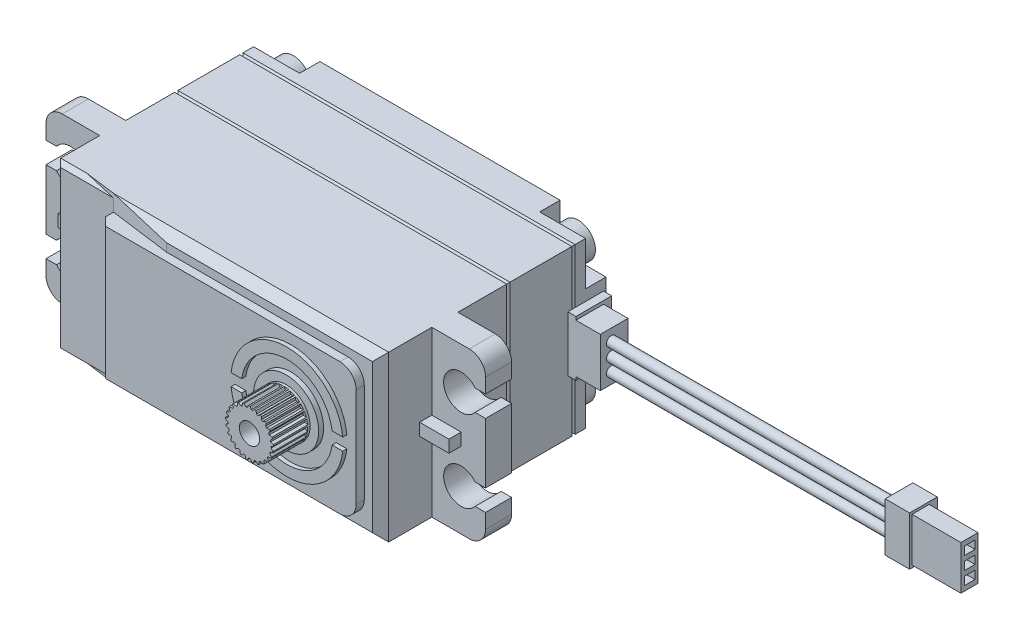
from build123d import *

# Parameters (mm, degrees)
SKETCH_1_W          = 40.8
SKETCH_1_H          = 20.2
EXTRUDE_1_DEPTH     = 4
CHAMFER_1_SIZE      = 0.2
SKETCH_2_W          = 40.8
SKETCH_2_H          = 20.2
EXTRUDE_2_DEPTH     = 8
CHAMFER_5_SIZE      = 0.2
SKETCH_3_W          = 40.8
SKETCH_3_H          = 20.2
EXTRUDE_3_DEPTH     = 15.7
CHAMFER_6_SIZE      = 0.2
CHAMFER_3_SIZE      = 1
CHAMFER_4_SIZE      = 0.2
SKETCH_4_R          = 6.9
EXTRUDE_4_DEPTH     = 1.5
SKETCH_5_R          = 4
EXTRUDE_5_DEPTH     = 0.1
SKETCH_6_R          = 2.95
EXTRUDE_6_DEPTH     = 4.5
SKETCH_7_R          = 1.25
CUT_EXTRUDE_1_DEPTH = 5
CUT_EXTRUDE_2_DEPTH = 4.2
EXTRUDE_7_DEPTH     = 3.2
FILLET_1_R          = 2
SKETCH_10_W         = 36.8
SKETCH_10_H         = 16.2
SKETCH_10_R         = 6.9
EXTRUDE_8_DEPTH     = 1
SKETCH_11_W         = 5
SKETCH_11_H         = 16.2
CUT_EXTRUDE_3_DEPTH = 1
FILLET_2_R          = 2
SKETCH_12_W         = 4.4
SKETCH_12_H         = 6.8
EXTRUDE_9_DEPTH     = 1
SKETCH_13_W         = 3.4
SKETCH_13_H         = 6
EXTRUDE_10_DEPTH    = 3
SKETCH_14_R         = 0.6
EXTRUDE_11_DEPTH    = 35
SKETCH_15_W         = 3.4
SKETCH_15_H         = 6
EXTRUDE_12_DEPTH    = 3
SKETCH_16_W         = 2.1
SKETCH_16_H         = 5.4
SKETCH_16_W_2       = 1.300246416
SKETCH_16_H_2       = 1
EXTRUDE_13_DEPTH    = 6
SKETCH_17_R         = 1
CUT_EXTRUDE_4_DEPTH = 2.5
SKETCH_18_R         = 1
CUT_EXTRUDE_5_DEPTH = 2.5
SKETCH_19_R         = 2.1
EXTRUDE_14_DEPTH    = 2
SKETCH_20_W         = 3.6
SKETCH_20_H         = 1.5
EXTRUDE_15_DEPTH    = 1.5
SKETCH_21_R         = 5.6
SKETCH_21_R_2       = 4
CUT_EXTRUDE_6_DEPTH = 0.5
CUT_EXTRUDE_7_DEPTH = 0.5
SKETCH_23_W         = 7
SKETCH_23_H         = 20.2
CUT_EXTRUDE_8_DEPTH = 1
CUT_EXTRUDE_9_DEPTH = 2
CHAMFER_7_SIZE      = 1
CHAMFER_9_SIZE      = 0.5


with BuildPart() as part:
    # Sketch 1 → Extrude 1 (new body)
    with BuildSketch(Plane.XY):
        Rectangle(SKETCH_1_W, SKETCH_1_H)
    extrude(amount=EXTRUDE_1_DEPTH)

    # Chamfer 1
    chamfer_1_edges = [part.edges().sort_by_distance(p)[0] for p in [
        (20.4, 0, 4),
        (0, 10.1, 4),
        (-20.4, 0, 4),
        (0, -10.1, 4),
    ]]
    chamfer(chamfer_1_edges, length=CHAMFER_1_SIZE)



with BuildPart() as body_2:
    # Sketch 2 → Extrude 2 (new body)
    with BuildSketch(Plane.XY.offset(4)):
        Rectangle(SKETCH_2_W, SKETCH_2_H)
    extrude(amount=EXTRUDE_2_DEPTH)

    # Chamfer 5
    chamfer_5_edges = [body_2.edges().sort_by_distance(p)[0] for p in [
        (0, -10.1, 12),
        (20.4, 0, 12),
        (0, 10.1, 12),
        (-20.4, 0, 12),
    ]]
    chamfer(chamfer_5_edges, length=CHAMFER_5_SIZE)

    # Chamfer 4
    chamfer_4_edges = [body_2.edges().sort_by_distance(p)[0] for p in [
        (20.4, 0, 4),
        (0, -10.1, 4),
        (-20.4, 0, 4),
        (0, 10.1, 4),
    ]]
    chamfer(chamfer_4_edges, length=CHAMFER_4_SIZE)


with BuildPart() as body_3:
    # Sketch 3 → Extrude 3 (new body)
    with BuildSketch(Plane.XY.offset(12)):
        Rectangle(SKETCH_3_W, SKETCH_3_H)
    extrude(amount=EXTRUDE_3_DEPTH)

    # Chamfer 6
    chamfer_6_edges = [body_3.edges().sort_by_distance(p)[0] for p in [
        (20.4, 0, 12),
        (0, -10.1, 12),
        (-20.4, 0, 12),
        (0, 10.1, 12),
    ]]
    chamfer(chamfer_6_edges, length=CHAMFER_6_SIZE)

    # Chamfer 3
    chamfer_3_edges = [body_3.edges().sort_by_distance(p)[0] for p in [
        (0, -10.1, 27.7),
        (20.4, 0, 27.7),
        (0, 10.1, 27.7),
        (-20.4, 0, 27.7),
    ]]
    chamfer(chamfer_3_edges, length=CHAMFER_3_SIZE)

    # Sketch 4 → Extrude 4 (add)
    with BuildSketch(Plane.XY.offset(27.7)):
        with Locations(Location((10.4, 0, 0), (0, 0, 180))):
            Circle(SKETCH_4_R)
    extrude(amount=EXTRUDE_4_DEPTH)

    # Sketch 5 → Extrude 5 (add)
    with BuildSketch(Plane.XY.offset(29.2)):
        with Locations((10.4, 0)):
            Circle(SKETCH_5_R)
    extrude(amount=EXTRUDE_5_DEPTH)

    # Sketch 6 → Extrude 6 (add)
    with BuildSketch(Plane.XY.offset(29.3)):
        with Locations((10.4, 0)):
            Circle(SKETCH_6_R)
    extrude(amount=EXTRUDE_6_DEPTH)

    # Sketch 7 → Cut-Extrude 1 (cut)
    with BuildSketch(Plane.XY.offset(33.8)):
        with Locations((10.4, 0)):
            Circle(SKETCH_7_R)
    extrude(amount=-CUT_EXTRUDE_1_DEPTH, mode=Mode.SUBTRACT)

    # Sketch 8 → Cut-Extrude 2 (cut)
    with BuildSketch(Plane.XY.offset(33.8)):
        with BuildLine():
            Line((11.036355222, 2.880547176), (10.812882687, 2.613339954))
            ThreePointArc((10.812882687, 2.613339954), (10.718629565, 2.62690868), (10.623963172, 2.637206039))
            Line((10.623963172, 2.637206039), (10.475180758, 2.949041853))
            ThreePointArc((10.475180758, 2.949041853), (10.757412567, 2.928268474), (11.036355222, 2.880547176))
        make_face()
        with BuildLine():
            Line((10.3, 2.948304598), (10.15, 2.633916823))
            ThreePointArc((10.15, 2.633916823), (10.055333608, 2.623619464), (9.961080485, 2.610050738))
            Line((9.961080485, 2.610050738), (9.739421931, 2.875088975))
            ThreePointArc((9.739421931, 2.875088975), (10.017953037, 2.925156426), (10.3, 2.948304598))
        make_face()
        with BuildLine():
            Line((11.732725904, 2.631794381), (11.449822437, 2.428557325))
            ThreePointArc((11.449822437, 2.428557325), (11.361904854, 2.465139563), (11.27277343, 2.498655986))
            Line((11.27277343, 2.498655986), (11.206215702, 2.837695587))
            ThreePointArc((11.206215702, 2.837695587), (11.47441455, 2.747386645), (11.732725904, 2.631794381))
        make_face()
        with BuildLine():
            Line((12.345356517, 2.217676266), (12.020797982, 2.091179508))
            ThreePointArc((12.020797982, 2.091179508), (11.944740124, 2.148476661), (11.866744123, 2.203106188))
            Line((11.866744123, 2.203106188), (11.886593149, 2.54804647))
            ThreePointArc((11.886593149, 2.54804647), (12.123907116, 2.393876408), (12.345356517, 2.217676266))
        make_face()
        with BuildLine():
            Line((12.835753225, 1.664213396), (12.489932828, 1.622405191))
            ThreePointArc((12.489932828, 1.622405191), (12.430513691, 1.696817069), (12.368553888, 1.769127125))
            Line((12.368553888, 1.769127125), (12.47356248, 2.098294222))
            ThreePointArc((12.47356248, 2.098294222), (12.665080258, 1.889950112), (12.835753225, 1.664213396))
        make_face()
        with BuildLine():
            Line((13.1731026, 1.006181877), (12.827749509, 1.051689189))
            ThreePointArc((12.827749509, 1.051689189), (12.788702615, 1.13854022), (12.746672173, 1.223987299))
            Line((12.746672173, 1.223987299), (12.930242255, 1.516698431))
            ThreePointArc((12.930242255, 1.516698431), (13.063930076, 1.2672713), (13.1731026, 1.006181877))
        make_face()
        with BuildLine():
            Line((13.33620774, 0.28492825), (13.01302176, 0.414891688))
            ThreePointArc((13.01302176, 0.414891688), (12.996800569, 0.508724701), (12.977340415, 0.601939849))
            Line((12.977340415, 0.601939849), (13.227937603, 0.8398029))
            ThreePointArc((13.227937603, 0.8398029), (13.295395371, 0.564965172), (13.33620774, 0.28492825))
        make_face()
        with BuildLine():
            Line((13.314820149, -0.454228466), (13.034108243, -0.247974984))
            ThreePointArc((13.034108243, -0.247974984), (13.041731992, -0.153055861), (13.04606488, -0.057929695))
            Line((13.04606488, -0.057929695), (13.347943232, 0.110139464))
            ThreePointArc((13.347943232, 0.110139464), (13.344932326, -0.172839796), (13.314820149, -0.454228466))
        make_face()
        with BuildLine():
            Line((13.110283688, -1.164844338), (12.889684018, -0.895260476))
            ThreePointArc((12.889684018, -0.895260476), (12.920673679, -0.805219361), (12.948527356, -0.714159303))
            Line((12.948527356, -0.714159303), (13.282718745, -0.626444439))
            ThreePointArc((13.282718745, -0.626444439), (13.209428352, -0.899784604), (13.110283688, -1.164844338))
        make_face()
        with BuildLine():
            Line((12.735450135, -1.802268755), (12.58882379, -1.486293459))
            ThreePointArc((12.58882379, -1.486293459), (12.641232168, -1.406787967), (12.690856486, -1.325515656))
            Line((12.690856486, -1.325515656), (13.036362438, -1.323666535))
            ThreePointArc((13.036362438, -1.323666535), (12.897397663, -1.570192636), (12.735450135, -1.802268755))
        make_face()
        with BuildLine():
            Line((12.213871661, -2.326449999), (12.150431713, -1.983937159))
            ThreePointArc((12.150431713, -1.983937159), (12.220965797, -1.919962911), (12.289242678, -1.853584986))
            Line((12.289242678, -1.853584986), (12.624353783, -1.937717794))
            ThreePointArc((12.624353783, -1.937717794), (12.428446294, -2.14193969), (12.213871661, -2.326449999))
        make_face()
        with BuildLine():
            Line((11.57832096, -2.704451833), (11.602053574, -2.35692279))
            ThreePointArc((11.602053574, -2.35692279), (11.686281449, -2.312499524), (11.768920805, -2.265186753))
            Line((11.768920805, -2.265186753), (12.072580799, -2.430015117))
            ThreePointArc((12.072580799, -2.430015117), (11.832040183, -2.579100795), (11.57832096, -2.704451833))
        make_face()
        with BuildLine():
            Line((10.868732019, -2.912523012), (10.978145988, -2.581814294))
            ThreePointArc((10.978145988, -2.581814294), (11.070775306, -2.559733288), (11.162584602, -2.534458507))
            Line((11.162584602, -2.534458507), (11.415713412, -2.769625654))
            ThreePointArc((11.415713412, -2.769625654), (11.145653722, -2.854207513), (10.868732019, -2.912523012))
        make_face()
        with BuildLine():
            Line((10.129690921, -2.937589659), (10.317911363, -2.644480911))
            ThreePointArc((10.317911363, -2.644480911), (10.413121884, -2.646129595), (10.508332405, -2.644480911))
            Line((10.508332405, -2.644480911), (10.695025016, -2.935210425))
            ThreePointArc((10.695025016, -2.935210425), (10.412415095, -2.949973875), (10.129690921, -2.937589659))
        make_face()
        with BuildLine():
            Line((9.407634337, -2.778076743), (9.662834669, -2.540985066))
            ThreePointArc((9.662834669, -2.540985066), (9.754643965, -2.566259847), (9.847273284, -2.588340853))
            Line((9.847273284, -2.588340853), (9.955799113, -2.91636513))
            ThreePointArc((9.955799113, -2.91636513), (9.678396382, -2.86038253), (9.407634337, -2.778076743))
        make_face()
        with BuildLine():
            Line((8.747931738, -2.444007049), (9.054076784, -2.277829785))
            ThreePointArc((9.054076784, -2.277829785), (9.13671614, -2.325142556), (9.220944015, -2.369565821))
            Line((9.220944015, -2.369565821), (9.244483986, -2.714273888))
            ThreePointArc((9.244483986, -2.714273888), (8.989718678, -2.59106283), (8.747931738, -2.444007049))
        make_face()
        with BuildLine():
            Line((8.192034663, -1.956371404), (8.529888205, -1.871550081))
            ThreePointArc((8.529888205, -1.871550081), (8.598165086, -1.937928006), (8.66869917, -2.001902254))
            Line((8.66869917, -2.001902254), (8.605774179, -2.341634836))
            ThreePointArc((8.605774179, -2.341634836), (8.389654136, -2.158937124), (8.192034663, -1.956371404))
        make_face()
        with BuildLine():
            Line((7.77487217, -1.345809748), (8.123205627, -1.347674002))
            ThreePointArc((8.123205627, -1.347674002), (8.172829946, -1.428946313), (8.225238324, -1.508451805))
            Line((8.225238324, -1.508451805), (8.07980218, -1.821862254))
            ThreePointArc((8.07980218, -1.821862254), (7.915907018, -1.591157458), (7.77487217, -1.345809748))
        make_face()
        with BuildLine():
            Line((7.522656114, -0.650685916), (7.859582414, -0.73911861))
            ThreePointArc((7.859582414, -0.73911861), (7.887436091, -0.830178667), (7.918425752, -0.920219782))
            Line((7.918425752, -0.920219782), (7.699616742, -1.187615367))
            ThreePointArc((7.699616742, -1.187615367), (7.598244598, -0.923399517), (7.522656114, -0.650685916))
        make_face()
        with BuildLine():
            Line((7.451234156, 0.085322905), (7.75558298, -0.084121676))
            ThreePointArc((7.75558298, -0.084121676), (7.759915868, -0.179247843), (7.767539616, -0.274166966))
            Line((7.767539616, -0.274166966), (7.489106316, -0.478746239))
            ThreePointArc((7.489106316, -0.478746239), (7.456626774, -0.197620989), (7.451234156, 0.085322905))
        make_face()
        with BuildLine():
            Line((7.565094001, 0.815970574), (7.817741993, 0.576160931))
            ThreePointArc((7.817741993, 0.576160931), (7.79828184, 0.482945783), (7.782060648, 0.38911277))
            Line((7.782060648, 0.38911277), (7.461498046, 0.260204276))
            ThreePointArc((7.461498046, 0.260204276), (7.499951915, 0.540574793), (7.565094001, 0.815970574))
        make_face()
        with BuildLine():
            Line((7.857081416, 1.495347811), (8.042153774, 1.200241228))
            ThreePointArc((8.042153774, 1.200241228), (8.000123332, 1.114794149), (7.961076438, 1.027943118))
            Line((7.961076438, 1.027943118), (7.61852666, 0.9828052))
            ThreePointArc((7.61852666, 0.9828052), (7.725497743, 1.244804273), (7.857081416, 1.495347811))
        make_face()
        with BuildLine():
            Line((8.308849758, 2.080766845), (8.414717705, 1.748905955))
            ThreePointArc((8.414717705, 1.748905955), (8.352757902, 1.676595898), (8.293338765, 1.602184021))
            Line((8.293338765, 1.602184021), (7.950325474, 1.643652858))
            ThreePointArc((7.950325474, 1.643652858), (8.119092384, 1.870818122), (8.308849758, 2.080766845))
        make_face()
        with BuildLine():
            Line((8.89201276, 2.535443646), (8.912024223, 2.187680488))
            ThreePointArc((8.912024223, 2.187680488), (8.834028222, 2.133050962), (8.757970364, 2.075753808))
            Line((8.757970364, 2.075753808), (8.436046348, 2.201223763))
            ThreePointArc((8.436046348, 2.201223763), (8.656004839, 2.379281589), (8.89201276, 2.535443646))
        make_face()
        with BuildLine():
            Line((9.569928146, 2.830809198), (9.502825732, 2.488995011))
            ThreePointArc((9.502825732, 2.488995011), (9.413694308, 2.455478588), (9.325776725, 2.41889635))
            Line((9.325776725, 2.41889635), (9.045169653, 2.620483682))
            ThreePointArc((9.045169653, 2.620483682), (9.302498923, 2.738246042), (9.569928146, 2.830809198))
        make_face()
    extrude(amount=-CUT_EXTRUDE_2_DEPTH, mode=Mode.SUBTRACT)

    # Sketch 9 → Extrude 7 (add)
    with BuildSketch(Plane.XY.offset(18.2)):
        with BuildLine():
            Line((20.4, -10.1), (27, -10.1))
            Line((27, -10.1), (27, -6.3))
            Line((27, -6.3), (25.712454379, -6.3))
            ThreePointArc((25.712454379, -6.3), (21.85, -5), (25.712454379, -3.7))
            Line((25.712454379, -3.7), (27, -3.7))
            Line((27, -3.7), (27, 3.7))
            Line((27, 3.7), (25.712454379, 3.7))
            ThreePointArc((25.712454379, 3.7), (21.85, 5), (25.712454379, 6.3))
            Line((25.712454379, 6.3), (27, 6.3))
            Line((27, 6.3), (27, 10.1))
            Line((27, 10.1), (20.4, 10.1))
            Line((20.4, 10.1), (20.4, -10.1))
        make_face()
        with BuildLine():
            Line((-27, 10.1), (-27, 6.3))
            Line((-27, 6.3), (-25.712454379, 6.3))
            ThreePointArc((-25.712454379, 6.3), (-21.85, 5), (-25.712454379, 3.7))
            Line((-25.712454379, 3.7), (-27, 3.7))
            Line((-27, 3.7), (-27, -3.7))
            Line((-27, -3.7), (-25.712454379, -3.7))
            ThreePointArc((-25.712454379, -3.7), (-21.85, -5), (-25.712454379, -6.3))
            Line((-25.712454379, -6.3), (-27, -6.3))
            Line((-27, -6.3), (-27, -10.1))
            Line((-27, -10.1), (-20.4, -10.1))
            Line((-20.4, -10.1), (-20.4, 10.1))
            Line((-20.4, 10.1), (-27, 10.1))
        make_face()
    extrude(amount=EXTRUDE_7_DEPTH)

    # Fillet 1
    fillet_1_edges = [body_3.edges().sort_by_distance(p)[0] for p in [
        (-27, -10.1, 19.8),
        (-27, 10.1, 19.8),
        (27, -10.1, 19.8),
        (27, 10.1, 19.8),
    ]]
    fillet(fillet_1_edges, radius=FILLET_1_R)

    # Sketch 10 → Extrude 8 (add)
    with BuildSketch(Plane.XY.offset(27.7)):
        Rectangle(SKETCH_10_W, SKETCH_10_H)
        with Locations((10.4, 0)):
            Circle(SKETCH_10_R, mode=Mode.SUBTRACT)
    extrude(amount=EXTRUDE_8_DEPTH)

    # Sketch 11 → Cut-Extrude 3 (cut)
    with BuildSketch(Plane.XY.offset(28.7)):
        with Locations((-15.9, 0)):
            Rectangle(SKETCH_11_W, SKETCH_11_H)
    extrude(amount=-CUT_EXTRUDE_3_DEPTH, mode=Mode.SUBTRACT)

    # Fillet 2
    fillet_2_edges = [body_3.edges().sort_by_distance(p)[0] for p in [
        (18.4, 8.1, 28.2),
        (18.4, -8.1, 28.2),
    ]]
    fillet(fillet_2_edges, radius=FILLET_2_R)

    # Sketch 20 → Extrude 15 (add)
    with BuildSketch(Plane.XY.offset(21.4)):
        with Locations((-22.2, 0)):
            Rectangle(SKETCH_20_W, SKETCH_20_H)
        with Locations((22.2, 0)):
            Rectangle(SKETCH_20_W, SKETCH_20_H)
    extrude(amount=EXTRUDE_15_DEPTH)

    # Sketch 21 → Cut-Extrude 6 (cut)
    with BuildSketch(Plane.XY.offset(29.2)):
        with Locations((10.4, 0)):
            Circle(SKETCH_21_R)
        with Locations((10.4, 0)):
            Circle(SKETCH_21_R_2, mode=Mode.SUBTRACT)
    extrude(amount=-CUT_EXTRUDE_6_DEPTH, mode=Mode.SUBTRACT)

    # Sketch 22 → Cut-Extrude 7 (cut)
    with BuildSketch(Plane.XY.offset(29.2)):
        with BuildLine():
            Line((3.540881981, -0.75), (4.850450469, -0.75))
            ThreePointArc((4.850450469, -0.75), (4.8, 0), (4.850450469, 0.75))
            Line((4.850450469, 0.75), (3.540881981, 0.75))
            ThreePointArc((3.540881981, 0.75), (3.5, 0), (3.540881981, -0.75))
        make_face()
        with BuildLine():
            Line((15.949549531, -0.75), (17.259118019, -0.75))
            ThreePointArc((17.259118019, -0.75), (17.3, 0), (17.259118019, 0.75))
            Line((17.259118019, 0.75), (15.949549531, 0.75))
            ThreePointArc((15.949549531, 0.75), (16, 0), (15.949549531, -0.75))
        make_face()
    extrude(amount=-CUT_EXTRUDE_7_DEPTH, mode=Mode.SUBTRACT)

    # Sketch 23 → Cut-Extrude 8 (cut)
    with BuildSketch(Plane.XY.offset(27.7)):
        with Locations((-16.9, 0)):
            Rectangle(SKETCH_23_W, SKETCH_23_H)
    extrude(amount=-CUT_EXTRUDE_8_DEPTH, mode=Mode.SUBTRACT)

    # Sketch 24 → Cut-Extrude 9 (cut)
    with BuildSketch(Plane.XZ.offset(10.1)):
        Polygon((-13.4, 26.7), (-5.9, 27.7), (-13.4, 27.7), align=None)
    cut_extrude_9 = extrude(amount=-CUT_EXTRUDE_9_DEPTH, mode=Mode.SUBTRACT)

    # Mirror 2: Cut-Extrude 9 across plane
    add(cut_extrude_9.mirror(Plane.ZX), mode=Mode.SUBTRACT)

    # Chamfer 7
    chamfer_7_edges = [body_3.edges().sort_by_distance(p)[0] for p in [
        (-13.4, 0, 28.7),
    ]]
    chamfer(chamfer_7_edges, length=CHAMFER_7_SIZE)

    # Chamfer 9
    chamfer_9_edges = [body_3.edges().sort_by_distance(p)[0] for p in [
        (-20.4, 0, 26.7),
        (-16.9, 10.1, 26.7),
        (-16.9, -10.1, 26.7),
    ]]
    chamfer(chamfer_9_edges, length=CHAMFER_9_SIZE)


with BuildPart() as part_1:
    add(part.part)

    add(body_2.part)  # Extrude 9 merges body 2
    # Sketch 12 → Extrude 9 (add)
    with BuildSketch(Plane(origin=(20.4, 0, 0), x_dir=(0, 0, -1), z_dir=(1, 0, 0))):
        with Locations((-2.5, 0)):
            Rectangle(SKETCH_12_W, SKETCH_12_H)
    extrude(amount=EXTRUDE_9_DEPTH)

    # Sketch 13 → Extrude 10 (add)
    with BuildSketch(Plane(origin=(21.4, 0, 0), x_dir=(0, 0, -1), z_dir=(1, 0, 0))):
        with Locations((-3, 0)):
            Rectangle(SKETCH_13_W, SKETCH_13_H)
    extrude(amount=EXTRUDE_10_DEPTH)

    # Sketch 14 → Extrude 11 (add)
    with BuildSketch(Plane(origin=(24.4, 0, 0), x_dir=(0, 0, -1), z_dir=(1, 0, 0))):
        with Locations((-3.35, 1.6)):
            Circle(SKETCH_14_R)
        with Locations((-3.35, 0)):
            Circle(SKETCH_14_R)
        with Locations((-3.35, -1.6)):
            Circle(SKETCH_14_R)
    extrude(amount=EXTRUDE_11_DEPTH)

    # Sketch 15 → Extrude 12 (add)
    with BuildSketch(Plane(origin=(59.4, 0, 0), x_dir=(0, 0, -1), z_dir=(1, 0, 0))):
        with Locations((-3, 0)):
            Rectangle(SKETCH_15_W, SKETCH_15_H)
    extrude(amount=EXTRUDE_12_DEPTH)

    # Sketch 16 → Extrude 13 (add)
    with BuildSketch(Plane(origin=(62.4, 0, 0), x_dir=(0, 0, -1), z_dir=(1, 0, 0))):
        with Locations((-3.35, 0)):
            Rectangle(SKETCH_16_W, SKETCH_16_H)
        with Locations((-3.316419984, 1.6)):
            Rectangle(SKETCH_16_W_2, SKETCH_16_H_2, mode=Mode.SUBTRACT)
        with Locations((-3.316419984, 0)):
            Rectangle(SKETCH_16_W_2, SKETCH_16_H_2, mode=Mode.SUBTRACT)
        with Locations((-3.316419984, -1.6)):
            Rectangle(SKETCH_16_W_2, SKETCH_16_H_2, mode=Mode.SUBTRACT)
    extrude(amount=EXTRUDE_13_DEPTH)

    # Sketch 17 → Cut-Extrude 4 (cut)
    # profile 1 of 4: a face of its own
    with BuildSketch(Plane(origin=(0, 0, 0), x_dir=(-1, 0, 0), z_dir=(0, 0, -1))):
        with BuildLine():
            Line((-14.75, 7.5), (-14.75, 10.1))
            Line((-14.75, 10.1), (-20.4, 10.1))
            Line((-20.4, 10.1), (-20.4, 4.75))
            Line((-20.4, 4.75), (-17.5, 4.75))
            ThreePointArc((-17.5, 4.75), (-15.555456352, 5.555456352), (-14.75, 7.5))
        make_face()
        with Locations((-17.5, 7.5)):
            Circle(SKETCH_17_R, mode=Mode.SUBTRACT)
    # profile 2 of 4: a face of its own
    with BuildSketch(Plane(origin=(0, 0, 0), x_dir=(-1, 0, 0), z_dir=(0, 0, -1))):
        with BuildLine():
            Line((-17.5, -4.75), (-20.4, -4.75))
            Line((-20.4, -4.75), (-20.4, -10.1))
            Line((-20.4, -10.1), (-14.75, -10.1))
            Line((-14.75, -10.1), (-14.75, -7.5))
            ThreePointArc((-14.75, -7.5), (-15.555456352, -5.555456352), (-17.5, -4.75))
        make_face()
        with Locations((-17.5, -7.5)):
            Circle(SKETCH_17_R, mode=Mode.SUBTRACT)
    # profile 3 of 4: a face of its own
    with BuildSketch(Plane(origin=(0, 0, 0), x_dir=(-1, 0, 0), z_dir=(0, 0, -1))):
        with BuildLine():
            Line((17.5, -4.75), (20.4, -4.75))
            Line((20.4, -4.75), (20.4, -10.1))
            Line((20.4, -10.1), (14.75, -10.1))
            Line((14.75, -10.1), (14.75, -7.5))
            ThreePointArc((14.75, -7.5), (15.555456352, -5.555456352), (17.5, -4.75))
        make_face()
        with Locations((17.5, -7.5)):
            Circle(SKETCH_17_R, mode=Mode.SUBTRACT)
    # profile 4 of 4: a face of its own
    with BuildSketch(Plane(origin=(0, 0, 0), x_dir=(-1, 0, 0), z_dir=(0, 0, -1))):
        with BuildLine():
            Line((14.75, 7.5), (14.75, 10.1))
            Line((14.75, 10.1), (20.4, 10.1))
            Line((20.4, 10.1), (20.4, 4.75))
            Line((20.4, 4.75), (17.5, 4.75))
            ThreePointArc((17.5, 4.75), (15.555456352, 5.555456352), (14.75, 7.5))
        make_face()
        with Locations((17.5, 7.5)):
            Circle(SKETCH_17_R, mode=Mode.SUBTRACT)
    extrude(amount=-CUT_EXTRUDE_4_DEPTH, mode=Mode.SUBTRACT)

    # Sketch 18 → Cut-Extrude 5 (cut)
    with BuildSketch(Plane(origin=(0, 0, 0), x_dir=(-1, 0, 0), z_dir=(0, 0, -1))):
        with Locations((-17.5, -7.5)):
            Circle(SKETCH_18_R)
        with Locations((-17.5, 7.5)):
            Circle(SKETCH_18_R)
        with Locations((17.5, 7.5)):
            Circle(SKETCH_18_R)
        with Locations((17.5, -7.5)):
            Circle(SKETCH_18_R)
    extrude(amount=-CUT_EXTRUDE_5_DEPTH, mode=Mode.SUBTRACT)

    # Sketch 19 → Extrude 14 (add)
    # profile 1 of 4: a face of its own
    with BuildSketch(Plane(origin=(0, 0, 2.5), x_dir=(-1, 0, 0), z_dir=(0, 0, -1))):
        with Locations((-17.5, 7.5)):
            Circle(SKETCH_19_R)
        with BuildLine():
            Line((-18, 7), (-18, 5.822949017))
            ThreePointArc((-18, 5.822949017), (-17.5, 5.75), (-17, 5.822949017))
            Line((-17, 5.822949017), (-17, 7))
            Line((-17, 7), (-15.822949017, 7))
            ThreePointArc((-15.822949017, 7), (-15.75, 7.5), (-15.822949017, 8))
            Line((-15.822949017, 8), (-17, 8))
            Line((-17, 8), (-17, 9.177050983))
            ThreePointArc((-17, 9.177050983), (-17.5, 9.25), (-18, 9.177050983))
            Line((-18, 9.177050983), (-18, 8))
            Line((-18, 8), (-19.177050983, 8))
            ThreePointArc((-19.177050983, 8), (-19.25, 7.5), (-19.177050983, 7))
            Line((-19.177050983, 7), (-18, 7))
        make_face(mode=Mode.SUBTRACT)
    # profile 2 of 4: a face of its own
    with BuildSketch(Plane(origin=(0, 0, 2.5), x_dir=(-1, 0, 0), z_dir=(0, 0, -1))):
        with Locations(Location((-17.5, -7.5, 0), (0, 0, 180))):
            Circle(SKETCH_19_R)
        with BuildLine():
            Line((-17, -7), (-15.822949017, -7))
            ThreePointArc((-15.822949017, -7), (-15.75, -7.5), (-15.822949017, -8))
            Line((-15.822949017, -8), (-17, -8))
            Line((-17, -8), (-17, -9.177050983))
            ThreePointArc((-17, -9.177050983), (-17.5, -9.25), (-18, -9.177050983))
            Line((-18, -9.177050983), (-18, -8))
            Line((-18, -8), (-19.177050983, -8))
            ThreePointArc((-19.177050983, -8), (-19.25, -7.5), (-19.177050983, -7))
            Line((-19.177050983, -7), (-18, -7))
            Line((-18, -7), (-18, -5.822949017))
            ThreePointArc((-18, -5.822949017), (-17.5, -5.75), (-17, -5.822949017))
            Line((-17, -5.822949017), (-17, -7))
        make_face(mode=Mode.SUBTRACT)
    # profile 3 of 4: a face of its own
    with BuildSketch(Plane(origin=(0, 0, 2.5), x_dir=(-1, 0, 0), z_dir=(0, 0, -1))):
        with Locations(Location((17.5, 7.5, 0), (0, 0, 180))):
            Circle(SKETCH_19_R)
        with BuildLine():
            Line((17, 8), (15.822949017, 8))
            ThreePointArc((15.822949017, 8), (15.75, 7.5), (15.822949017, 7))
            Line((15.822949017, 7), (17, 7))
            Line((17, 7), (17, 5.822949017))
            ThreePointArc((17, 5.822949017), (17.5, 5.75), (18, 5.822949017))
            Line((18, 5.822949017), (18, 7))
            Line((18, 7), (19.177050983, 7))
            ThreePointArc((19.177050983, 7), (19.25, 7.5), (19.177050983, 8))
            Line((19.177050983, 8), (18, 8))
            Line((18, 8), (18, 9.177050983))
            ThreePointArc((18, 9.177050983), (17.5, 9.25), (17, 9.177050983))
            Line((17, 9.177050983), (17, 8))
        make_face(mode=Mode.SUBTRACT)
    # profile 4 of 4: a face of its own
    with BuildSketch(Plane(origin=(0, 0, 2.5), x_dir=(-1, 0, 0), z_dir=(0, 0, -1))):
        with Locations((17.5, -7.5)):
            Circle(SKETCH_19_R)
        with BuildLine():
            Line((17, -8), (15.822949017, -8))
            ThreePointArc((15.822949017, -8), (15.75, -7.5), (15.822949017, -7))
            Line((15.822949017, -7), (17, -7))
            Line((17, -7), (17, -5.822949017))
            ThreePointArc((17, -5.822949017), (17.5, -5.75), (18, -5.822949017))
            Line((18, -5.822949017), (18, -7))
            Line((18, -7), (19.177050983, -7))
            ThreePointArc((19.177050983, -7), (19.25, -7.5), (19.177050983, -8))
            Line((19.177050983, -8), (18, -8))
            Line((18, -8), (18, -9.177050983))
            ThreePointArc((18, -9.177050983), (17.5, -9.25), (17, -9.177050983))
            Line((17, -9.177050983), (17, -8))
        make_face(mode=Mode.SUBTRACT)
    extrude(amount=EXTRUDE_14_DEPTH)


solid = Compound([body_3.part, part_1.part])
